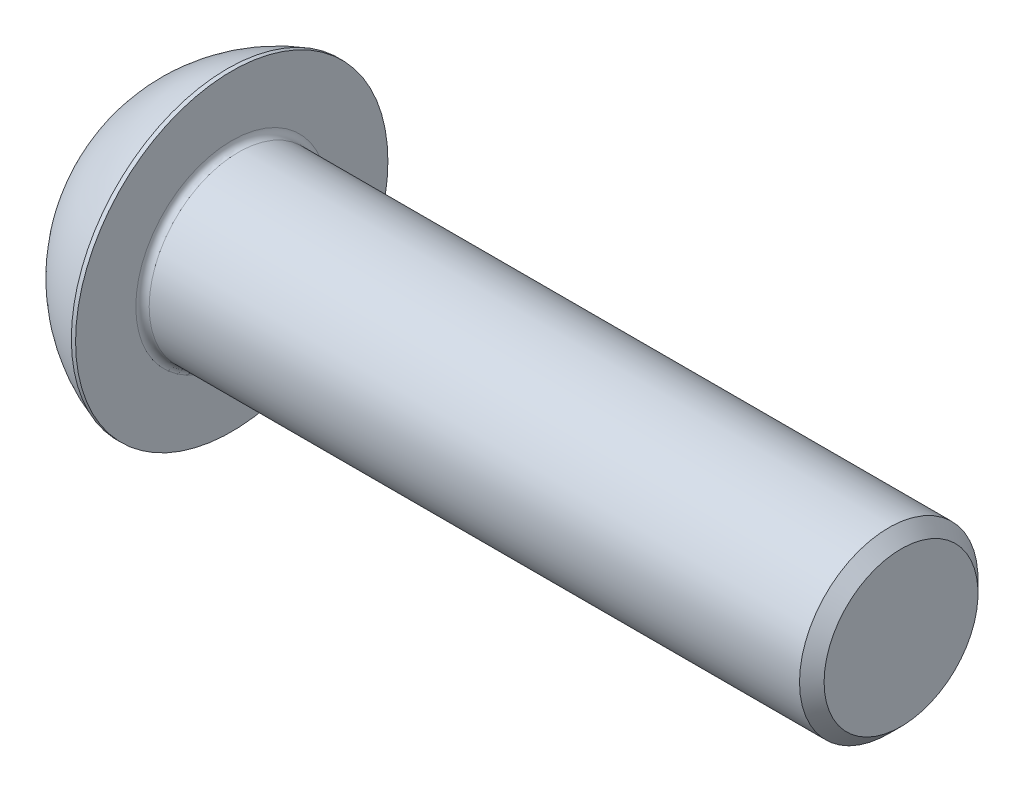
ISO-10303-21;
HEADER;
FILE_DESCRIPTION(('STEP AP214'),'2;1');
FILE_NAME('part.step','',(''),(''),'','','');
FILE_SCHEMA(('AUTOMOTIVE_DESIGN { 1 0 10303 214 1 1 1 1 }'));
ENDSEC;
DATA;
#1=APPLICATION_CONTEXT('core data for automotive mechanical design processes');
#2=APPLICATION_PROTOCOL_DEFINITION('international standard','automotive_design',2000,#1);
#3=PRODUCT_CONTEXT('',#1,'mechanical');
#4=PRODUCT('Part','Part','',(#3));
#5=PRODUCT_RELATED_PRODUCT_CATEGORY('part','',(#4));
#6=PRODUCT_DEFINITION_FORMATION('','',#4);
#7=PRODUCT_DEFINITION_CONTEXT('part definition',#1,'design');
#8=PRODUCT_DEFINITION('design','',#6,#7);
#9=PRODUCT_DEFINITION_SHAPE('','',#8);
#10=(LENGTH_UNIT() NAMED_UNIT(*) SI_UNIT(.MILLI.,.METRE.));
#11=(NAMED_UNIT(*) PLANE_ANGLE_UNIT() SI_UNIT($,.RADIAN.));
#12=(NAMED_UNIT(*) SI_UNIT($,.STERADIAN.) SOLID_ANGLE_UNIT());
#13=UNCERTAINTY_MEASURE_WITH_UNIT(LENGTH_MEASURE(1.E-05),#10,'distance_accuracy_value','');
#14=(GEOMETRIC_REPRESENTATION_CONTEXT(3) GLOBAL_UNCERTAINTY_ASSIGNED_CONTEXT((#13)) GLOBAL_UNIT_ASSIGNED_CONTEXT((#10,
#11,#12)) REPRESENTATION_CONTEXT('',''));
#15=CARTESIAN_POINT('',(0.,0.,0.));
#16=DIRECTION('',(0.,0.,1.));
#17=DIRECTION('',(1.,0.,0.));
#18=AXIS2_PLACEMENT_3D('',#15,#16,#17);
#19=CARTESIAN_POINT('',(0.,0.,0.));
#20=DIRECTION('',(-1.,0.,0.));
#21=DIRECTION('',(0.,0.,1.));
#22=AXIS2_PLACEMENT_3D('',#19,#20,#21);
#23=PLANE('',#22);
#24=CARTESIAN_POINT('',(0.,0.,0.));
#25=DIRECTION('',(-1.,0.,0.));
#26=DIRECTION('',(0.,0.,1.));
#27=AXIS2_PLACEMENT_3D('',#24,#25,#26);
#28=CIRCLE('',#27,7.);
#29=CARTESIAN_POINT('',(0.,7.,0.));
#30=VERTEX_POINT('',#29);
#31=EDGE_CURVE('E166',#30,#30,#28,.T.);
#32=ORIENTED_EDGE('',*,*,#31,.T.);
#33=EDGE_LOOP('',(#32));
#34=FACE_BOUND('',#33,.T.);
#35=DIRECTION('',(0.,-1.,0.));
#36=VECTOR('',#35,1.);
#37=CARTESIAN_POINT('',(0.,-2.88675134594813,5.));
#38=LINE('',#37,#36);
#39=CARTESIAN_POINT('',(0.,2.88675134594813,5.));
#40=VERTEX_POINT('',#39);
#41=CARTESIAN_POINT('',(0.,-2.88675134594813,5.));
#42=VERTEX_POINT('',#41);
#43=EDGE_CURVE('E56',#40,#42,#38,.T.);
#44=ORIENTED_EDGE('',*,*,#43,.T.);
#45=DIRECTION('',(0.,-0.5,-0.866025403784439));
#46=VECTOR('',#45,1.);
#47=CARTESIAN_POINT('',(0.,-5.77350269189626,0.));
#48=LINE('',#47,#46);
#49=CARTESIAN_POINT('',(0.,-5.77350269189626,0.));
#50=VERTEX_POINT('',#49);
#51=EDGE_CURVE('E260',#42,#50,#48,.T.);
#52=ORIENTED_EDGE('',*,*,#51,.T.);
#53=DIRECTION('',(0.,0.5,-0.866025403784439));
#54=VECTOR('',#53,1.);
#55=CARTESIAN_POINT('',(0.,-2.88675134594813,-5.));
#56=LINE('',#55,#54);
#57=CARTESIAN_POINT('',(0.,-2.88675134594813,-5.));
#58=VERTEX_POINT('',#57);
#59=EDGE_CURVE('E141',#50,#58,#56,.T.);
#60=ORIENTED_EDGE('',*,*,#59,.T.);
#61=DIRECTION('',(0.,1.,0.));
#62=VECTOR('',#61,1.);
#63=CARTESIAN_POINT('',(0.,2.88675134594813,-5.));
#64=LINE('',#63,#62);
#65=CARTESIAN_POINT('',(0.,2.88675134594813,-5.));
#66=VERTEX_POINT('',#65);
#67=EDGE_CURVE('E263',#58,#66,#64,.T.);
#68=ORIENTED_EDGE('',*,*,#67,.T.);
#69=DIRECTION('',(0.,0.5,0.866025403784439));
#70=VECTOR('',#69,1.);
#71=CARTESIAN_POINT('',(0.,5.77350269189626,0.));
#72=LINE('',#71,#70);
#73=CARTESIAN_POINT('',(0.,5.77350269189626,0.));
#74=VERTEX_POINT('',#73);
#75=EDGE_CURVE('E265',#66,#74,#72,.T.);
#76=ORIENTED_EDGE('',*,*,#75,.T.);
#77=DIRECTION('',(0.,-0.5,0.866025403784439));
#78=VECTOR('',#77,1.);
#79=CARTESIAN_POINT('',(0.,2.88675134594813,5.));
#80=LINE('',#79,#78);
#81=EDGE_CURVE('E267',#74,#40,#80,.T.);
#82=ORIENTED_EDGE('',*,*,#81,.T.);
#83=EDGE_LOOP('',(#44,#52,#60,#68,#76,#82));
#84=FACE_BOUND('',#83,.T.);
#85=ADVANCED_FACE('F41',(#34,#84),#23,.T.);
#86=CARTESIAN_POINT('',(12.939216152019,0.,0.));
#87=DIRECTION('',(-1.,0.,0.));
#88=DIRECTION('',(0.,1.,0.));
#89=AXIS2_PLACEMENT_3D('',#86,#87,#88);
#90=SPHERICAL_SURFACE('',#89,14.711332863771);
#91=CARTESIAN_POINT('',(8.42,0.,0.));
#92=DIRECTION('',(-1.,0.,0.));
#93=DIRECTION('',(0.,0.,1.));
#94=AXIS2_PLACEMENT_3D('',#91,#92,#93);
#95=CIRCLE('',#94,14.);
#96=CARTESIAN_POINT('',(8.42,14.,0.));
#97=VERTEX_POINT('',#96);
#98=EDGE_CURVE('E163',#97,#97,#95,.T.);
#99=CARTESIAN_POINT('',(8.42,14.,0.));
#100=CARTESIAN_POINT('',(8.30877949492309,13.9640981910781,0.));
#101=CARTESIAN_POINT('',(8.19798699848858,13.9268704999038,0.));
#102=CARTESIAN_POINT('',(7.9773205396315,13.8497856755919,0.));
#103=CARTESIAN_POINT('',(7.86744657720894,13.8099285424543,0.));
#104=CARTESIAN_POINT('',(7.64867970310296,13.7276071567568,0.));
#105=CARTESIAN_POINT('',(7.53978679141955,13.6851429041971,0.));
#106=CARTESIAN_POINT('',(7.3230438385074,13.5976314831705,0.));
#107=CARTESIAN_POINT('',(7.21519379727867,13.5525843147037,0.));
#108=CARTESIAN_POINT('',(7.00059785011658,13.4599326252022,0.));
#109=CARTESIAN_POINT('',(6.89385194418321,13.4123281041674,0.));
#110=CARTESIAN_POINT('',(6.68152489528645,13.3145887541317,0.));
#111=CARTESIAN_POINT('',(6.57594375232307,13.2644539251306,0.));
#112=CARTESIAN_POINT('',(6.36600619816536,13.1616824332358,0.));
#113=CARTESIAN_POINT('',(6.26164978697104,13.109045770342,0.));
#114=CARTESIAN_POINT('',(6.05422096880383,13.0013005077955,0.));
#115=CARTESIAN_POINT('',(5.95114856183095,12.9461919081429,0.));
#116=CARTESIAN_POINT('',(5.74634629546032,12.8335340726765,0.));
#117=CARTESIAN_POINT('',(5.64461643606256,12.7759848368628,0.));
#118=CARTESIAN_POINT('',(5.4425570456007,12.6584784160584,0.));
#119=CARTESIAN_POINT('',(5.34222751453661,12.5985212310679,0.));
#120=CARTESIAN_POINT('',(5.14302576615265,12.4762329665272,0.));
#121=CARTESIAN_POINT('',(5.04415354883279,12.4139018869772,0.));
#122=CARTESIAN_POINT('',(4.84792258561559,12.2869012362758,0.));
#123=CARTESIAN_POINT('',(4.75056383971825,12.2222316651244,0.));
#124=CARTESIAN_POINT('',(4.55741511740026,12.0905907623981,0.));
#125=CARTESIAN_POINT('',(4.46162514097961,12.023619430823,0.));
#126=CARTESIAN_POINT('',(4.27166836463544,11.8874130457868,0.));
#127=CARTESIAN_POINT('',(4.17750156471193,11.8181779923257,0.));
#128=CARTESIAN_POINT('',(3.99084462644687,11.6774834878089,0.));
#129=CARTESIAN_POINT('',(3.89835448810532,11.6060240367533,0.));
#130=CARTESIAN_POINT('',(3.71510340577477,11.4609213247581,0.));
#131=CARTESIAN_POINT('',(3.62434246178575,11.3872780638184,0.));
#132=CARTESIAN_POINT('',(3.44460131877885,11.237849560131,0.));
#133=CARTESIAN_POINT('',(3.35562111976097,11.1620643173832,0.));
#134=CARTESIAN_POINT('',(3.17949200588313,11.0083948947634,0.));
#135=CARTESIAN_POINT('',(3.09234309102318,10.9305107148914,0.));
#136=CARTESIAN_POINT('',(2.91992604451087,10.7726876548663,0.));
#137=CARTESIAN_POINT('',(2.8346579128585,10.6927487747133,0.));
#138=CARTESIAN_POINT('',(2.66605086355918,10.5308617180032,0.));
#139=CARTESIAN_POINT('',(2.58271194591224,10.448913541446,0.));
#140=CARTESIAN_POINT('',(2.4180106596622,10.2830544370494,0.));
#141=CARTESIAN_POINT('',(2.33664829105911,10.1991435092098,0.));
#142=CARTESIAN_POINT('',(2.17594631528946,10.0294065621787,0.));
#143=CARTESIAN_POINT('',(2.09660670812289,9.94358054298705,0.));
#144=CARTESIAN_POINT('',(1.93999531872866,9.77006216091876,0.));
#145=CARTESIAN_POINT('',(1.86272353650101,9.68236979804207,0.));
#146=CARTESIAN_POINT('',(1.71029168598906,9.50516853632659,0.));
#147=CARTESIAN_POINT('',(1.63513161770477,9.4156596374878,0.));
#148=CARTESIAN_POINT('',(1.48696588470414,9.23487614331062,0.));
#149=CARTESIAN_POINT('',(1.41396021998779,9.14360154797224,0.));
#150=CARTESIAN_POINT('',(1.27014475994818,8.95933850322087,0.));
#151=CARTESIAN_POINT('',(1.19933496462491,8.86635005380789,0.));
#152=CARTESIAN_POINT('',(1.05995146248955,8.67871211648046,0.));
#153=CARTESIAN_POINT('',(0.991377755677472,8.58406262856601,0.));
#154=CARTESIAN_POINT('',(0.856505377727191,8.39315637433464,0.));
#155=CARTESIAN_POINT('',(0.790206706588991,8.29689960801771,0.));
#156=CARTESIAN_POINT('',(0.659922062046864,8.10283346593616,0.));
#157=CARTESIAN_POINT('',(0.595936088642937,8.00502409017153,0.));
#158=CARTESIAN_POINT('',(0.470313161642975,7.80790829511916,0.));
#159=CARTESIAN_POINT('',(0.408676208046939,7.70860187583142,0.));
#160=CARTESIAN_POINT('',(0.287786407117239,7.50854835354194,0.));
#161=CARTESIAN_POINT('',(0.228533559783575,7.40780125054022,0.));
#162=CARTESIAN_POINT('',(0.112445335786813,7.2049237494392,0.));
#163=CARTESIAN_POINT('',(0.0556099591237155,7.10279335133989,0.));
#164=CARTESIAN_POINT('',(0.,7.,0.));
#165=B_SPLINE_CURVE_WITH_KNOTS('',3,(#99,#100,#101,#102,#103,#104,#105,#106,#107,#108,#109,#110,
#111,#112,#113,#114,#115,#116,#117,#118,#119,#120,#121,#122,#123,#124,#125,#126,#127,#128,#129,
#130,#131,#132,#133,#134,#135,#136,#137,#138,#139,#140,#141,#142,#143,#144,#145,#146,#147,#148,
#149,#150,#151,#152,#153,#154,#155,#156,#157,#158,#159,#160,#161,#162,#163,#164),.UNSPECIFIED.,
.F.,.F.,(4,2,2,2,2,2,2,2,2,2,2,2,2,2,2,2,2,2,2,2,2,2,2,2,2,2,2,2,2,2,2,2,4),(0.,
0.35060609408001,0.70121218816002,1.05181828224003,1.40242437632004,1.75303047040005,
2.10363656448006,2.45424265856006,2.80484875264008,3.15545484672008,3.50606094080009,
3.8566670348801,4.20727312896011,4.55787922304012,4.90848531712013,5.25909141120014,
5.60969750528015,5.96030359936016,6.31090969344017,6.66151578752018,7.01212188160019,
7.3627279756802,7.71333406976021,8.06394016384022,8.41454625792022,8.76515235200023,
9.11575844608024,9.46636454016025,9.81697063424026,10.1675767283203,10.5181828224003,
10.8687889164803,11.2193950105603),.UNSPECIFIED.);
#166=EDGE_CURVE('BSEAM188',#97,#30,#165,.T.);
#167=ORIENTED_EDGE('',*,*,#98,.T.);
#168=ORIENTED_EDGE('',*,*,#31,.F.);
#169=ORIENTED_EDGE('',*,*,#166,.T.);
#170=ORIENTED_EDGE('',*,*,#166,.F.);
#171=EDGE_LOOP('',(#167,#169,#168,#170));
#172=FACE_BOUND('',#171,.T.);
#173=ADVANCED_FACE('F188',(#172),#90,.T.);
#174=CARTESIAN_POINT('',(0.,0.,0.));
#175=DIRECTION('',(-1.,0.,0.));
#176=DIRECTION('',(0.,0.,1.));
#177=AXIS2_PLACEMENT_3D('',#174,#175,#176);
#178=CYLINDRICAL_SURFACE('',#177,14.);
#179=ORIENTED_EDGE('',*,*,#98,.F.);
#180=EDGE_LOOP('',(#179));
#181=FACE_BOUND('',#180,.T.);
#182=CARTESIAN_POINT('',(8.8,0.,0.));
#183=DIRECTION('',(-1.,0.,0.));
#184=DIRECTION('',(0.,0.,1.));
#185=AXIS2_PLACEMENT_3D('',#182,#183,#184);
#186=CIRCLE('',#185,14.);
#187=CARTESIAN_POINT('',(8.8,0.,14.));
#188=VERTEX_POINT('',#187);
#189=EDGE_CURVE('E160',#188,#188,#186,.T.);
#190=ORIENTED_EDGE('',*,*,#189,.T.);
#191=EDGE_LOOP('',(#190));
#192=FACE_BOUND('',#191,.T.);
#193=ADVANCED_FACE('F193',(#181,#192),#178,.T.);
#194=CARTESIAN_POINT('',(8.8,8.,0.));
#195=DIRECTION('',(-1.,0.,0.));
#196=DIRECTION('',(0.,0.,1.));
#197=AXIS2_PLACEMENT_3D('',#194,#195,#196);
#198=PLANE('',#197);
#199=CARTESIAN_POINT('',(8.8,0.,0.));
#200=DIRECTION('',(-1.,0.,0.));
#201=DIRECTION('',(0.,0.,1.));
#202=AXIS2_PLACEMENT_3D('',#199,#200,#201);
#203=CIRCLE('',#202,8.6);
#204=CARTESIAN_POINT('',(8.8,0.,8.6));
#205=VERTEX_POINT('',#204);
#206=EDGE_CURVE('E49',#205,#205,#203,.T.);
#207=ORIENTED_EDGE('',*,*,#206,.T.);
#208=EDGE_LOOP('',(#207));
#209=FACE_BOUND('',#208,.T.);
#210=ORIENTED_EDGE('',*,*,#189,.F.);
#211=EDGE_LOOP('',(#210));
#212=FACE_BOUND('',#211,.T.);
#213=ADVANCED_FACE('F171',(#209,#212),#198,.F.);
#214=CARTESIAN_POINT('',(0.,0.,0.));
#215=DIRECTION('',(-1.,0.,0.));
#216=DIRECTION('',(0.,0.,1.));
#217=AXIS2_PLACEMENT_3D('',#214,#215,#216);
#218=CYLINDRICAL_SURFACE('',#217,8.);
#219=CARTESIAN_POINT('',(9.4,0.,0.));
#220=DIRECTION('',(-1.,0.,0.));
#221=DIRECTION('',(0.,0.,1.));
#222=AXIS2_PLACEMENT_3D('',#219,#220,#221);
#223=CIRCLE('',#222,8.);
#224=CARTESIAN_POINT('',(9.4,0.,8.));
#225=VERTEX_POINT('',#224);
#226=EDGE_CURVE('E11',#225,#225,#223,.F.);
#227=ORIENTED_EDGE('',*,*,#226,.T.);
#228=EDGE_LOOP('',(#227));
#229=FACE_BOUND('',#228,.T.);
#230=CARTESIAN_POINT('',(67.6985,0.,0.));
#231=DIRECTION('',(-1.,0.,0.));
#232=DIRECTION('',(0.,0.,1.));
#233=AXIS2_PLACEMENT_3D('',#230,#231,#232);
#234=CIRCLE('',#233,8.);
#235=CARTESIAN_POINT('',(67.6985,0.,8.));
#236=VERTEX_POINT('',#235);
#237=EDGE_CURVE('E157',#236,#236,#234,.T.);
#238=ORIENTED_EDGE('',*,*,#237,.T.);
#239=EDGE_LOOP('',(#238));
#240=FACE_BOUND('',#239,.T.);
#241=ADVANCED_FACE('F202',(#229,#240),#218,.T.);
#242=CARTESIAN_POINT('',(68.8,0.,0.));
#243=DIRECTION('',(-1.,0.,0.));
#244=DIRECTION('',(0.,0.,1.));
#245=AXIS2_PLACEMENT_3D('',#242,#243,#244);
#246=CONICAL_SURFACE('',#245,6.8985,0.78539816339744);
#247=ORIENTED_EDGE('',*,*,#237,.F.);
#248=EDGE_LOOP('',(#247));
#249=FACE_BOUND('',#248,.T.);
#250=CARTESIAN_POINT('',(68.8,0.,0.));
#251=DIRECTION('',(-1.,0.,0.));
#252=DIRECTION('',(0.,0.,1.));
#253=AXIS2_PLACEMENT_3D('',#250,#251,#252);
#254=CIRCLE('',#253,6.8985);
#255=CARTESIAN_POINT('',(68.8,0.,6.8985));
#256=VERTEX_POINT('',#255);
#257=EDGE_CURVE('E153',#256,#256,#254,.T.);
#258=ORIENTED_EDGE('',*,*,#257,.T.);
#259=EDGE_LOOP('',(#258));
#260=FACE_BOUND('',#259,.T.);
#261=ADVANCED_FACE('F184',(#249,#260),#246,.T.);
#262=CARTESIAN_POINT('',(68.8,0.,0.));
#263=DIRECTION('',(-1.,0.,0.));
#264=DIRECTION('',(0.,0.,1.));
#265=AXIS2_PLACEMENT_3D('',#262,#263,#264);
#266=PLANE('',#265);
#267=ORIENTED_EDGE('',*,*,#257,.F.);
#268=EDGE_LOOP('',(#267));
#269=FACE_BOUND('',#268,.T.);
#270=ADVANCED_FACE('F175',(#269),#266,.F.);
#271=CARTESIAN_POINT('',(9.4,0.,0.));
#272=DIRECTION('',(-1.,0.,0.));
#273=DIRECTION('',(0.,0.,1.));
#274=AXIS2_PLACEMENT_3D('',#271,#272,#273);
#275=TOROIDAL_SURFACE('',#274,8.6,0.6);
#276=ORIENTED_EDGE('',*,*,#226,.F.);
#277=EDGE_LOOP('',(#276));
#278=FACE_BOUND('',#277,.T.);
#279=ORIENTED_EDGE('',*,*,#206,.F.);
#280=EDGE_LOOP('',(#279));
#281=FACE_BOUND('',#280,.T.);
#282=ADVANCED_FACE('F43',(#278,#281),#275,.F.);
#283=CARTESIAN_POINT('',(3.0988,-5.77350269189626,0.));
#284=DIRECTION('',(0.,0.866025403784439,-0.5));
#285=DIRECTION('',(0.,0.5,0.866025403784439));
#286=AXIS2_PLACEMENT_3D('',#283,#284,#285);
#287=PLANE('',#286);
#288=DIRECTION('',(0.,-0.5,-0.866025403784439));
#289=VECTOR('',#288,1.);
#290=CARTESIAN_POINT('',(3.0988,-5.77350269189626,0.));
#291=LINE('',#290,#289);
#292=CARTESIAN_POINT('',(3.0988,-2.88675134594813,5.));
#293=VERTEX_POINT('',#292);
#294=CARTESIAN_POINT('',(3.0988,-4.33012701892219,2.5));
#295=VERTEX_POINT('',#294);
#296=EDGE_CURVE('E124',#293,#295,#291,.T.);
#297=ORIENTED_EDGE('',*,*,#296,.T.);
#298=CARTESIAN_POINT('',(3.0988,-5.77350269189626,0.));
#299=VERTEX_POINT('',#298);
#300=EDGE_CURVE('E117',#295,#299,#291,.T.);
#301=ORIENTED_EDGE('',*,*,#300,.T.);
#302=DIRECTION('',(-1.,0.,0.));
#303=VECTOR('',#302,1.);
#304=CARTESIAN_POINT('',(3.0988,-5.77350269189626,0.));
#305=LINE('',#304,#303);
#306=EDGE_CURVE('E121',#299,#50,#305,.T.);
#307=ORIENTED_EDGE('',*,*,#306,.T.);
#308=ORIENTED_EDGE('',*,*,#51,.F.);
#309=DIRECTION('',(-1.,0.,0.));
#310=VECTOR('',#309,1.);
#311=CARTESIAN_POINT('',(3.0988,-2.88675134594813,5.));
#312=LINE('',#311,#310);
#313=EDGE_CURVE('E250',#293,#42,#312,.T.);
#314=ORIENTED_EDGE('',*,*,#313,.F.);
#315=EDGE_LOOP('',(#297,#301,#307,#308,#314));
#316=FACE_BOUND('',#315,.T.);
#317=ADVANCED_FACE('F119',(#316),#287,.T.);
#318=CARTESIAN_POINT('',(3.0988,-2.88675134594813,-5.));
#319=DIRECTION('',(0.,0.866025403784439,0.5));
#320=DIRECTION('',(0.,-0.5,0.866025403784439));
#321=AXIS2_PLACEMENT_3D('',#318,#319,#320);
#322=PLANE('',#321);
#323=DIRECTION('',(0.,0.5,-0.866025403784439));
#324=VECTOR('',#323,1.);
#325=CARTESIAN_POINT('',(3.0988,-2.88675134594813,-5.));
#326=LINE('',#325,#324);
#327=CARTESIAN_POINT('',(3.0988,-4.33012701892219,-2.5));
#328=VERTEX_POINT('',#327);
#329=EDGE_CURVE('E129',#299,#328,#326,.T.);
#330=ORIENTED_EDGE('',*,*,#329,.T.);
#331=CARTESIAN_POINT('',(3.0988,-2.88675134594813,-5.));
#332=VERTEX_POINT('',#331);
#333=EDGE_CURVE('E136',#328,#332,#326,.T.);
#334=ORIENTED_EDGE('',*,*,#333,.T.);
#335=DIRECTION('',(-1.,0.,0.));
#336=VECTOR('',#335,1.);
#337=CARTESIAN_POINT('',(3.0988,-2.88675134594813,-5.));
#338=LINE('',#337,#336);
#339=EDGE_CURVE('E143',#332,#58,#338,.T.);
#340=ORIENTED_EDGE('',*,*,#339,.T.);
#341=ORIENTED_EDGE('',*,*,#59,.F.);
#342=ORIENTED_EDGE('',*,*,#306,.F.);
#343=EDGE_LOOP('',(#330,#334,#340,#341,#342));
#344=FACE_BOUND('',#343,.T.);
#345=ADVANCED_FACE('F139',(#344),#322,.T.);
#346=CARTESIAN_POINT('',(3.0988,2.88675134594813,-5.));
#347=DIRECTION('',(0.,0.,1.));
#348=DIRECTION('',(1.,0.,0.));
#349=AXIS2_PLACEMENT_3D('',#346,#347,#348);
#350=PLANE('',#349);
#351=DIRECTION('',(0.,1.,0.));
#352=VECTOR('',#351,1.);
#353=CARTESIAN_POINT('',(3.0988,2.88675134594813,-5.));
#354=LINE('',#353,#352);
#355=CARTESIAN_POINT('',(3.0988,0.,-5.));
#356=VERTEX_POINT('',#355);
#357=EDGE_CURVE('E286',#332,#356,#354,.T.);
#358=ORIENTED_EDGE('',*,*,#357,.T.);
#359=CARTESIAN_POINT('',(3.0988,2.88675134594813,-5.));
#360=VERTEX_POINT('',#359);
#361=EDGE_CURVE('E135',#356,#360,#354,.T.);
#362=ORIENTED_EDGE('',*,*,#361,.T.);
#363=DIRECTION('',(-1.,0.,0.));
#364=VECTOR('',#363,1.);
#365=CARTESIAN_POINT('',(3.0988,2.88675134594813,-5.));
#366=LINE('',#365,#364);
#367=EDGE_CURVE('E148',#360,#66,#366,.T.);
#368=ORIENTED_EDGE('',*,*,#367,.T.);
#369=ORIENTED_EDGE('',*,*,#67,.F.);
#370=ORIENTED_EDGE('',*,*,#339,.F.);
#371=EDGE_LOOP('',(#358,#362,#368,#369,#370));
#372=FACE_BOUND('',#371,.T.);
#373=ADVANCED_FACE('F216',(#372),#350,.T.);
#374=CARTESIAN_POINT('',(3.0988,5.77350269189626,0.));
#375=DIRECTION('',(0.,-0.866025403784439,0.5));
#376=DIRECTION('',(0.,-0.5,-0.866025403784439));
#377=AXIS2_PLACEMENT_3D('',#374,#375,#376);
#378=PLANE('',#377);
#379=DIRECTION('',(0.,0.5,0.866025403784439));
#380=VECTOR('',#379,1.);
#381=CARTESIAN_POINT('',(3.0988,5.77350269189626,0.));
#382=LINE('',#381,#380);
#383=CARTESIAN_POINT('',(3.0988,4.33012701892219,-2.5));
#384=VERTEX_POINT('',#383);
#385=EDGE_CURVE('E292',#360,#384,#382,.T.);
#386=ORIENTED_EDGE('',*,*,#385,.T.);
#387=CARTESIAN_POINT('',(3.0988,5.77350269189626,0.));
#388=VERTEX_POINT('',#387);
#389=EDGE_CURVE('E290',#384,#388,#382,.T.);
#390=ORIENTED_EDGE('',*,*,#389,.T.);
#391=DIRECTION('',(-1.,0.,0.));
#392=VECTOR('',#391,1.);
#393=CARTESIAN_POINT('',(3.0988,5.77350269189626,0.));
#394=LINE('',#393,#392);
#395=EDGE_CURVE('E272',#388,#74,#394,.T.);
#396=ORIENTED_EDGE('',*,*,#395,.T.);
#397=ORIENTED_EDGE('',*,*,#75,.F.);
#398=ORIENTED_EDGE('',*,*,#367,.F.);
#399=EDGE_LOOP('',(#386,#390,#396,#397,#398));
#400=FACE_BOUND('',#399,.T.);
#401=ADVANCED_FACE('F219',(#400),#378,.T.);
#402=CARTESIAN_POINT('',(3.0988,2.88675134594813,5.));
#403=DIRECTION('',(0.,-0.866025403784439,-0.5));
#404=DIRECTION('',(0.,0.5,-0.866025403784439));
#405=AXIS2_PLACEMENT_3D('',#402,#403,#404);
#406=PLANE('',#405);
#407=DIRECTION('',(0.,-0.5,0.866025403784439));
#408=VECTOR('',#407,1.);
#409=CARTESIAN_POINT('',(3.0988,2.88675134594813,5.));
#410=LINE('',#409,#408);
#411=CARTESIAN_POINT('',(3.0988,4.33012701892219,2.5));
#412=VERTEX_POINT('',#411);
#413=EDGE_CURVE('E256',#388,#412,#410,.T.);
#414=ORIENTED_EDGE('',*,*,#413,.T.);
#415=CARTESIAN_POINT('',(3.0988,2.88675134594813,5.));
#416=VERTEX_POINT('',#415);
#417=EDGE_CURVE('E248',#412,#416,#410,.T.);
#418=ORIENTED_EDGE('',*,*,#417,.T.);
#419=DIRECTION('',(-1.,0.,0.));
#420=VECTOR('',#419,1.);
#421=CARTESIAN_POINT('',(3.0988,2.88675134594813,5.));
#422=LINE('',#421,#420);
#423=EDGE_CURVE('E254',#416,#40,#422,.T.);
#424=ORIENTED_EDGE('',*,*,#423,.T.);
#425=ORIENTED_EDGE('',*,*,#81,.F.);
#426=ORIENTED_EDGE('',*,*,#395,.F.);
#427=EDGE_LOOP('',(#414,#418,#424,#425,#426));
#428=FACE_BOUND('',#427,.T.);
#429=ADVANCED_FACE('F223',(#428),#406,.T.);
#430=CARTESIAN_POINT('',(3.0988,-2.88675134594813,5.));
#431=DIRECTION('',(0.,0.,-1.));
#432=DIRECTION('',(-1.,0.,0.));
#433=AXIS2_PLACEMENT_3D('',#430,#431,#432);
#434=PLANE('',#433);
#435=DIRECTION('',(0.,-1.,0.));
#436=VECTOR('',#435,1.);
#437=CARTESIAN_POINT('',(3.0988,-2.88675134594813,5.));
#438=LINE('',#437,#436);
#439=CARTESIAN_POINT('',(3.0988,0.,5.));
#440=VERTEX_POINT('',#439);
#441=EDGE_CURVE('E64',#416,#440,#438,.T.);
#442=ORIENTED_EDGE('',*,*,#441,.T.);
#443=EDGE_CURVE('E251',#440,#293,#438,.T.);
#444=ORIENTED_EDGE('',*,*,#443,.T.);
#445=ORIENTED_EDGE('',*,*,#313,.T.);
#446=ORIENTED_EDGE('',*,*,#43,.F.);
#447=ORIENTED_EDGE('',*,*,#423,.F.);
#448=EDGE_LOOP('',(#442,#444,#445,#446,#447));
#449=FACE_BOUND('',#448,.T.);
#450=ADVANCED_FACE('F227',(#449),#434,.T.);
#451=CARTESIAN_POINT('',(3.0988,-2.88675134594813,5.));
#452=DIRECTION('',(-1.,0.,0.));
#453=DIRECTION('',(0.,0.,1.));
#454=AXIS2_PLACEMENT_3D('',#451,#452,#453);
#455=PLANE('',#454);
#456=ORIENTED_EDGE('',*,*,#441,.F.);
#457=ORIENTED_EDGE('',*,*,#417,.F.);
#458=CARTESIAN_POINT('',(3.0988,0.,0.));
#459=DIRECTION('',(-1.,0.,0.));
#460=DIRECTION('',(0.,0.,1.));
#461=AXIS2_PLACEMENT_3D('',#458,#459,#460);
#462=CIRCLE('',#461,5.);
#463=EDGE_CURVE('E147',#440,#412,#462,.T.);
#464=ORIENTED_EDGE('',*,*,#463,.F.);
#465=EDGE_LOOP('',(#456,#457,#464));
#466=FACE_BOUND('',#465,.T.);
#467=ADVANCED_FACE('F231',(#466),#455,.T.);
#468=ORIENTED_EDGE('',*,*,#413,.F.);
#469=ORIENTED_EDGE('',*,*,#389,.F.);
#470=EDGE_CURVE('E154',#412,#384,#462,.T.);
#471=ORIENTED_EDGE('',*,*,#470,.F.);
#472=EDGE_LOOP('',(#468,#469,#471));
#473=FACE_BOUND('',#472,.T.);
#474=ADVANCED_FACE('F239',(#473),#455,.T.);
#475=ORIENTED_EDGE('',*,*,#385,.F.);
#476=ORIENTED_EDGE('',*,*,#361,.F.);
#477=EDGE_CURVE('E297',#384,#356,#462,.T.);
#478=ORIENTED_EDGE('',*,*,#477,.F.);
#479=EDGE_LOOP('',(#475,#476,#478));
#480=FACE_BOUND('',#479,.T.);
#481=ADVANCED_FACE('F244',(#480),#455,.T.);
#482=ORIENTED_EDGE('',*,*,#357,.F.);
#483=ORIENTED_EDGE('',*,*,#333,.F.);
#484=EDGE_CURVE('E289',#356,#328,#462,.T.);
#485=ORIENTED_EDGE('',*,*,#484,.F.);
#486=EDGE_LOOP('',(#482,#483,#485));
#487=FACE_BOUND('',#486,.T.);
#488=ADVANCED_FACE('F237',(#487),#455,.T.);
#489=ORIENTED_EDGE('',*,*,#329,.F.);
#490=ORIENTED_EDGE('',*,*,#300,.F.);
#491=EDGE_CURVE('E131',#328,#295,#462,.T.);
#492=ORIENTED_EDGE('',*,*,#491,.F.);
#493=EDGE_LOOP('',(#489,#490,#492));
#494=FACE_BOUND('',#493,.T.);
#495=ADVANCED_FACE('F130',(#494),#455,.T.);
#496=ORIENTED_EDGE('',*,*,#296,.F.);
#497=ORIENTED_EDGE('',*,*,#443,.F.);
#498=EDGE_CURVE('E142',#295,#440,#462,.T.);
#499=ORIENTED_EDGE('',*,*,#498,.F.);
#500=EDGE_LOOP('',(#496,#497,#499));
#501=FACE_BOUND('',#500,.T.);
#502=ADVANCED_FACE('F211',(#501),#455,.T.);
#503=CARTESIAN_POINT('',(5.98555134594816,0.,0.));
#504=DIRECTION('',(-1.,0.,0.));
#505=DIRECTION('',(0.,0.,1.));
#506=AXIS2_PLACEMENT_3D('',#503,#504,#505);
#507=CONICAL_SURFACE('',#506,0.,1.04719755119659);
#508=ORIENTED_EDGE('',*,*,#463,.T.);
#509=ORIENTED_EDGE('',*,*,#470,.T.);
#510=ORIENTED_EDGE('',*,*,#477,.T.);
#511=ORIENTED_EDGE('',*,*,#484,.T.);
#512=ORIENTED_EDGE('',*,*,#491,.T.);
#513=ORIENTED_EDGE('',*,*,#498,.T.);
#514=EDGE_LOOP('',(#508,#509,#510,#511,#512,#513));
#515=FACE_BOUND('',#514,.T.);
#516=CARTESIAN_POINT('',(5.98555134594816,0.,0.));
#517=VERTEX_POINT('',#516);
#518=VERTEX_LOOP('',#517);
#519=FACE_BOUND('',#518,.T.);
#520=ADVANCED_FACE('F209',(#515,#519),#507,.F.);
#521=CLOSED_SHELL('',(#85,#173,#193,#213,#241,#261,#270,#282,#317,#345,#373,#401,#429,#450,#467,
#474,#481,#488,#495,#502,#520));
#522=MANIFOLD_SOLID_BREP('B2',#521);
#523=ADVANCED_BREP_SHAPE_REPRESENTATION('',(#18,#522),#14);
#524=SHAPE_DEFINITION_REPRESENTATION(#9,#523);
ENDSEC;
END-ISO-10303-21;
